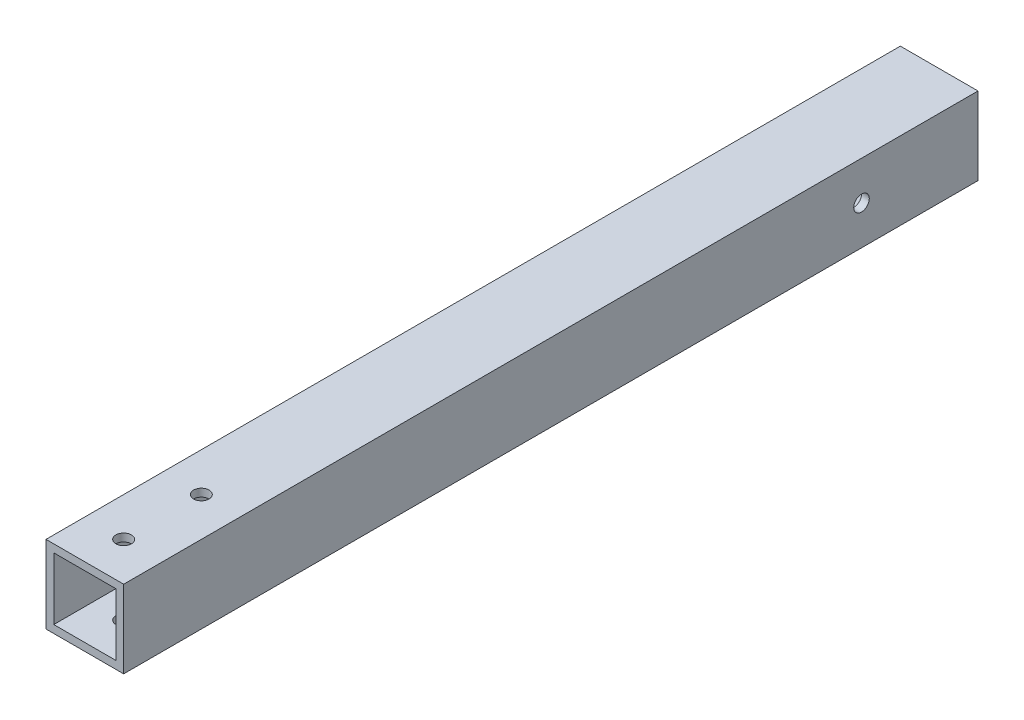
from build123d import *

# Parameters (mm, degrees)
SKETCH_1_W            = 20
SKETCH_1_H            = 20
SKETCH_1_W_2          = 16
SKETCH_1_H_2          = 16
EXTRUDE_1_DEPTH       = 220
HOLE_WIZARD_4_0_4_1_D = 4
HOLE_WIZARD_4_0_4_2_D = 4


with BuildPart() as part:
    # Sketch 1 → Extrude 1 (new body)
    with BuildSketch(Plane.XY):
        Rectangle(SKETCH_1_W, SKETCH_1_H)
        Rectangle(SKETCH_1_W_2, SKETCH_1_H_2, mode=Mode.SUBTRACT)
    extrude(amount=EXTRUDE_1_DEPTH)

    # Hole Wizard 4.0 _4_ _1 (through all)
    with Locations(Plane(origin=(0, 10, 0), x_dir=(1, 0, 0), z_dir=(0, 1, 0))):
        with Locations((0, -210), (0, -190)):
            Hole(HOLE_WIZARD_4_0_4_1_D / 2)

    # Hole Wizard 4.0 _4_ _2 (through all)
    with Locations(Plane.ZY.offset(10)):
        with Locations((30, 0)):
            Hole(HOLE_WIZARD_4_0_4_2_D / 2)


solid = part.part
